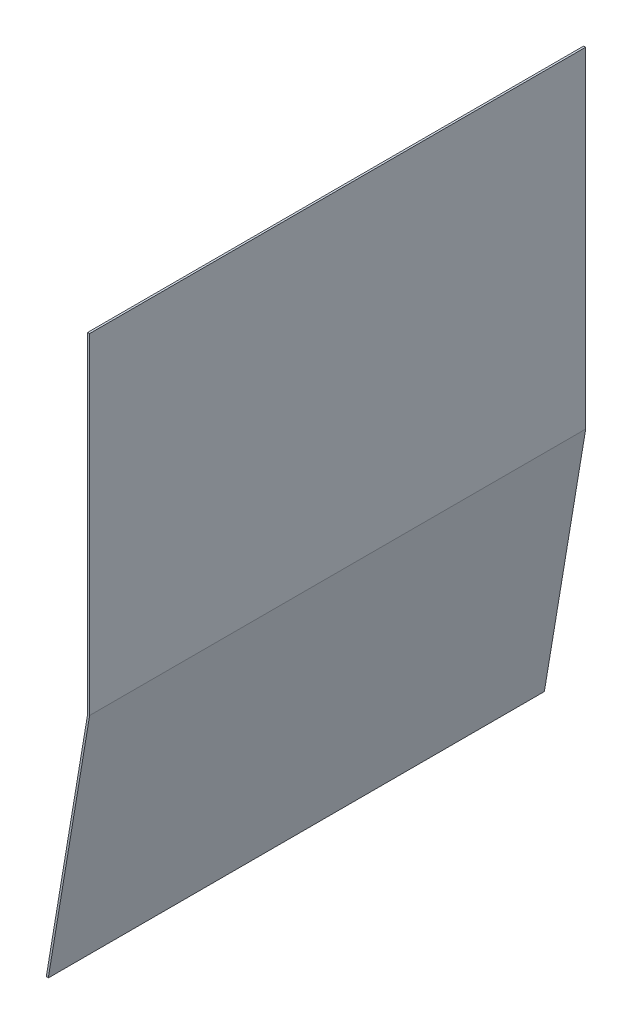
from build123d import *

# Parameters (mm, degrees)
EXTRUDE_THIN1_DEPTH = 300


with BuildPart() as part:
    # Sketch3 → Extrude-Thin1 (new body)
    with BuildSketch(Plane.XY):
        Polygon((0, 0), (0, -200), (-25, -350), (-26.197482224, -349.800419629), (-1.214, -199.899526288), (-1.214, 0), align=None)
    extrude(amount=EXTRUDE_THIN1_DEPTH)


solid = part.part
